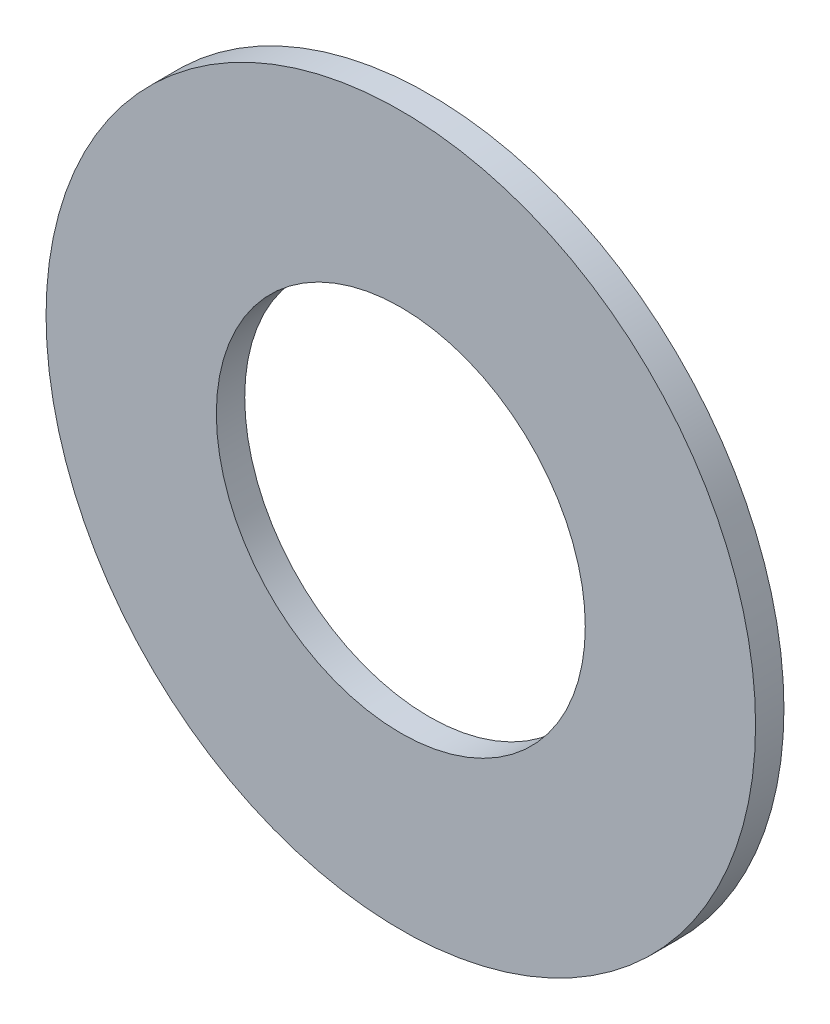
from build123d import *

# Parameters (mm, degrees)
SKETCH1_R      = 6.35
SKETCH1_R_2    = 3.302
EXTRUDE1_DEPTH = 0.508


with BuildPart() as part:
    # Sketch1 → Extrude1 (new body)
    with BuildSketch(Plane.XY):
        Circle(SKETCH1_R)
        Circle(SKETCH1_R_2, mode=Mode.SUBTRACT)
    extrude(amount=-EXTRUDE1_DEPTH)


solid = part.part
